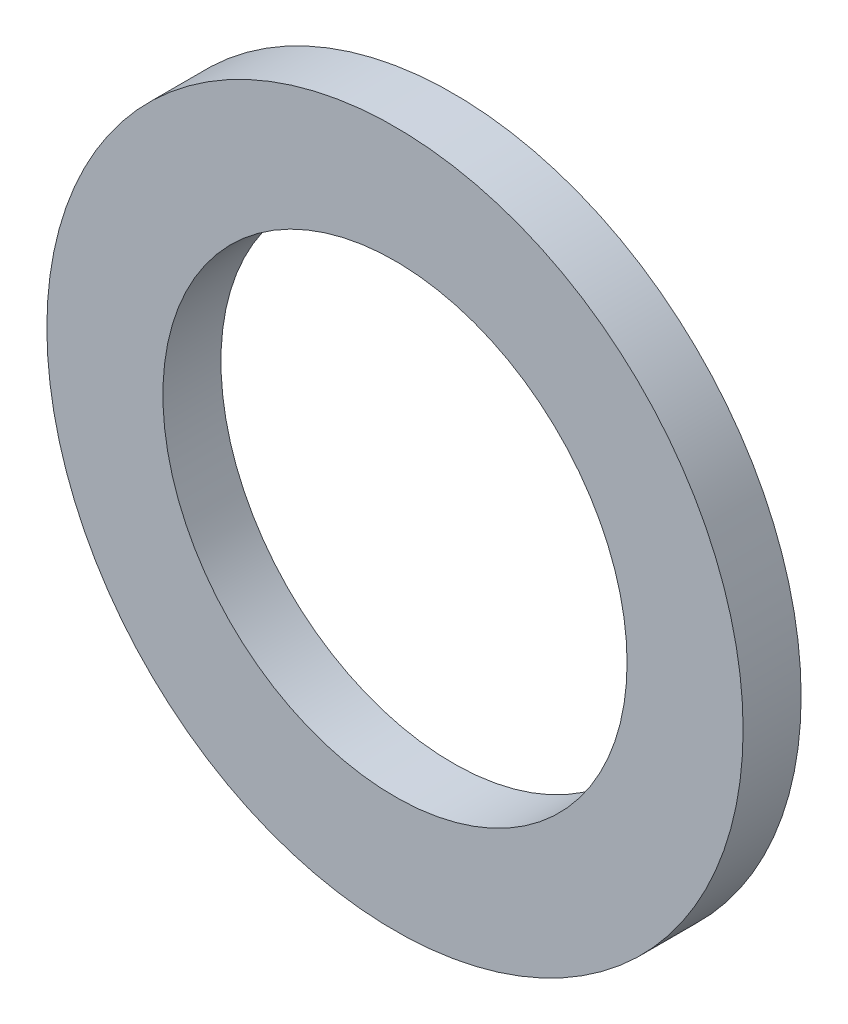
ISO-10303-21;
HEADER;
FILE_DESCRIPTION(('STEP AP214'),'2;1');
FILE_NAME('part.step','',(''),(''),'','','');
FILE_SCHEMA(('AUTOMOTIVE_DESIGN { 1 0 10303 214 1 1 1 1 }'));
ENDSEC;
DATA;
#1=APPLICATION_CONTEXT('core data for automotive mechanical design processes');
#2=APPLICATION_PROTOCOL_DEFINITION('international standard','automotive_design',2000,#1);
#3=PRODUCT_CONTEXT('',#1,'mechanical');
#4=PRODUCT('Part','Part','',(#3));
#5=PRODUCT_RELATED_PRODUCT_CATEGORY('part','',(#4));
#6=PRODUCT_DEFINITION_FORMATION('','',#4);
#7=PRODUCT_DEFINITION_CONTEXT('part definition',#1,'design');
#8=PRODUCT_DEFINITION('design','',#6,#7);
#9=PRODUCT_DEFINITION_SHAPE('','',#8);
#10=(LENGTH_UNIT() NAMED_UNIT(*) SI_UNIT(.MILLI.,.METRE.));
#11=(NAMED_UNIT(*) PLANE_ANGLE_UNIT() SI_UNIT($,.RADIAN.));
#12=(NAMED_UNIT(*) SI_UNIT($,.STERADIAN.) SOLID_ANGLE_UNIT());
#13=UNCERTAINTY_MEASURE_WITH_UNIT(LENGTH_MEASURE(1.E-05),#10,'distance_accuracy_value','');
#14=(GEOMETRIC_REPRESENTATION_CONTEXT(3) GLOBAL_UNCERTAINTY_ASSIGNED_CONTEXT((#13)) GLOBAL_UNIT_ASSIGNED_CONTEXT((#10,
#11,#12)) REPRESENTATION_CONTEXT('',''));
#15=CARTESIAN_POINT('',(0.,0.,0.));
#16=DIRECTION('',(0.,0.,1.));
#17=DIRECTION('',(1.,0.,0.));
#18=AXIS2_PLACEMENT_3D('',#15,#16,#17);
#19=CARTESIAN_POINT('',(0.,0.,0.));
#20=DIRECTION('',(0.,0.,-1.));
#21=DIRECTION('',(-1.,0.,0.));
#22=AXIS2_PLACEMENT_3D('',#19,#20,#21);
#23=CYLINDRICAL_SURFACE('',#22,3.);
#24=CARTESIAN_POINT('',(0.,0.,0.));
#25=DIRECTION('',(0.,0.,-1.));
#26=DIRECTION('',(1.,0.,0.));
#27=AXIS2_PLACEMENT_3D('',#24,#25,#26);
#28=CIRCLE('',#27,3.);
#29=CARTESIAN_POINT('',(3.,0.,0.));
#30=VERTEX_POINT('',#29);
#31=EDGE_CURVE('E10',#30,#30,#28,.T.);
#32=ORIENTED_EDGE('',*,*,#31,.T.);
#33=EDGE_LOOP('',(#32));
#34=FACE_BOUND('',#33,.T.);
#35=CARTESIAN_POINT('',(0.,0.,-0.5));
#36=DIRECTION('',(0.,0.,-1.));
#37=DIRECTION('',(1.,0.,0.));
#38=AXIS2_PLACEMENT_3D('',#35,#36,#37);
#39=CIRCLE('',#38,3.);
#40=CARTESIAN_POINT('',(3.,0.,-0.5));
#41=VERTEX_POINT('',#40);
#42=EDGE_CURVE('E354',#41,#41,#39,.T.);
#43=ORIENTED_EDGE('',*,*,#42,.F.);
#44=EDGE_LOOP('',(#43));
#45=FACE_BOUND('',#44,.T.);
#46=ADVANCED_FACE('F348',(#34,#45),#23,.T.);
#47=CARTESIAN_POINT('',(0.,0.,0.));
#48=DIRECTION('',(0.,0.,1.));
#49=DIRECTION('',(1.,0.,0.));
#50=AXIS2_PLACEMENT_3D('',#47,#48,#49);
#51=PLANE('',#50);
#52=CARTESIAN_POINT('',(0.,0.,0.));
#53=DIRECTION('',(0.,0.,-1.));
#54=DIRECTION('',(1.,0.,0.));
#55=AXIS2_PLACEMENT_3D('',#52,#53,#54);
#56=CIRCLE('',#55,2.00000000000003);
#57=CARTESIAN_POINT('',(2.00000000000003,0.,0.));
#58=VERTEX_POINT('',#57);
#59=EDGE_CURVE('E358',#58,#58,#56,.T.);
#60=ORIENTED_EDGE('',*,*,#59,.T.);
#61=EDGE_LOOP('',(#60));
#62=FACE_BOUND('',#61,.T.);
#63=ORIENTED_EDGE('',*,*,#31,.F.);
#64=EDGE_LOOP('',(#63));
#65=FACE_BOUND('',#64,.T.);
#66=ADVANCED_FACE('F372',(#62,#65),#51,.T.);
#67=CARTESIAN_POINT('',(0.,0.,-0.5));
#68=DIRECTION('',(0.,0.,1.));
#69=DIRECTION('',(1.,0.,0.));
#70=AXIS2_PLACEMENT_3D('',#67,#68,#69);
#71=PLANE('',#70);
#72=CARTESIAN_POINT('',(0.,0.,-0.5));
#73=DIRECTION('',(0.,0.,-1.));
#74=DIRECTION('',(1.,0.,0.));
#75=AXIS2_PLACEMENT_3D('',#72,#73,#74);
#76=CIRCLE('',#75,2.00000000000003);
#77=CARTESIAN_POINT('',(2.00000000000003,0.,-0.5));
#78=VERTEX_POINT('',#77);
#79=EDGE_CURVE('E362',#78,#78,#76,.T.);
#80=ORIENTED_EDGE('',*,*,#79,.F.);
#81=EDGE_LOOP('',(#80));
#82=FACE_BOUND('',#81,.T.);
#83=ORIENTED_EDGE('',*,*,#42,.T.);
#84=EDGE_LOOP('',(#83));
#85=FACE_BOUND('',#84,.T.);
#86=ADVANCED_FACE('F370',(#82,#85),#71,.F.);
#87=CARTESIAN_POINT('',(0.,0.,0.));
#88=DIRECTION('',(0.,0.,-1.));
#89=DIRECTION('',(-1.,0.,0.));
#90=AXIS2_PLACEMENT_3D('',#87,#88,#89);
#91=CYLINDRICAL_SURFACE('',#90,2.00000000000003);
#92=ORIENTED_EDGE('',*,*,#59,.F.);
#93=EDGE_LOOP('',(#92));
#94=FACE_BOUND('',#93,.T.);
#95=ORIENTED_EDGE('',*,*,#79,.T.);
#96=EDGE_LOOP('',(#95));
#97=FACE_BOUND('',#96,.T.);
#98=ADVANCED_FACE('F368',(#94,#97),#91,.F.);
#99=CLOSED_SHELL('',(#46,#66,#86,#98));
#100=MANIFOLD_SOLID_BREP('B2',#99);
#101=ADVANCED_BREP_SHAPE_REPRESENTATION('',(#18,#100),#14);
#102=SHAPE_DEFINITION_REPRESENTATION(#9,#101);
ENDSEC;
END-ISO-10303-21;
